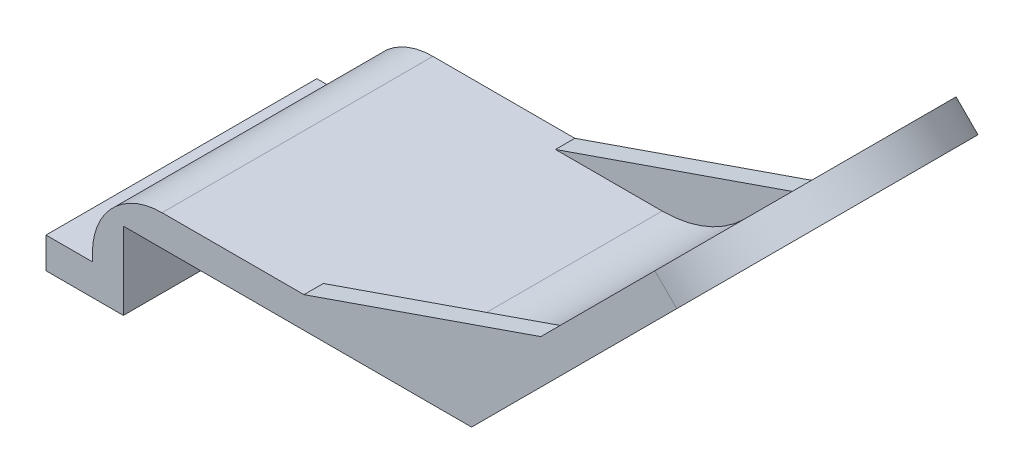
ISO-10303-21;
HEADER;
FILE_DESCRIPTION(('STEP AP214'),'2;1');
FILE_NAME('part.step','',(''),(''),'','','');
FILE_SCHEMA(('AUTOMOTIVE_DESIGN { 1 0 10303 214 1 1 1 1 }'));
ENDSEC;
DATA;
#1=APPLICATION_CONTEXT('core data for automotive mechanical design processes');
#2=APPLICATION_PROTOCOL_DEFINITION('international standard','automotive_design',2000,#1);
#3=PRODUCT_CONTEXT('',#1,'mechanical');
#4=PRODUCT('Part','Part','',(#3));
#5=PRODUCT_RELATED_PRODUCT_CATEGORY('part','',(#4));
#6=PRODUCT_DEFINITION_FORMATION('','',#4);
#7=PRODUCT_DEFINITION_CONTEXT('part definition',#1,'design');
#8=PRODUCT_DEFINITION('design','',#6,#7);
#9=PRODUCT_DEFINITION_SHAPE('','',#8);
#10=(LENGTH_UNIT() NAMED_UNIT(*) SI_UNIT(.MILLI.,.METRE.));
#11=(NAMED_UNIT(*) PLANE_ANGLE_UNIT() SI_UNIT($,.RADIAN.));
#12=(NAMED_UNIT(*) SI_UNIT($,.STERADIAN.) SOLID_ANGLE_UNIT());
#13=UNCERTAINTY_MEASURE_WITH_UNIT(LENGTH_MEASURE(1.E-05),#10,'distance_accuracy_value','');
#14=(GEOMETRIC_REPRESENTATION_CONTEXT(3) GLOBAL_UNCERTAINTY_ASSIGNED_CONTEXT((#13)) GLOBAL_UNIT_ASSIGNED_CONTEXT((#10,
#11,#12)) REPRESENTATION_CONTEXT('',''));
#15=CARTESIAN_POINT('',(0.,0.,0.));
#16=DIRECTION('',(0.,0.,1.));
#17=DIRECTION('',(1.,0.,0.));
#18=AXIS2_PLACEMENT_3D('',#15,#16,#17);
#19=CARTESIAN_POINT('',(0.,0.,88.9));
#20=DIRECTION('',(-0.707106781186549,0.707106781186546,0.));
#21=DIRECTION('',(-0.707106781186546,-0.707106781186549,0.));
#22=AXIS2_PLACEMENT_3D('',#19,#20,#21);
#23=PLANE('',#22);
#24=DIRECTION('',(0.707106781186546,0.707106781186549,0.));
#25=VECTOR('',#24,1.);
#26=CARTESIAN_POINT('',(0.,0.,-88.9));
#27=LINE('',#26,#25);
#28=CARTESIAN_POINT('',(0.,0.,-88.9));
#29=VERTEX_POINT('',#28);
#30=CARTESIAN_POINT('',(134.703841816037,134.703841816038,-88.9));
#31=VERTEX_POINT('',#30);
#32=EDGE_CURVE('E264',#29,#31,#27,.T.);
#33=ORIENTED_EDGE('',*,*,#32,.T.);
#34=CARTESIAN_POINT('',(134.703841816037,134.703841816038,0.));
#35=DIRECTION('',(-0.707106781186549,0.707106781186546,0.));
#36=DIRECTION('',(-0.707106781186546,-0.707106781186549,0.));
#37=AXIS2_PLACEMENT_3D('',#34,#35,#36);
#38=CIRCLE('',#37,88.9);
#39=CARTESIAN_POINT('',(134.703841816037,134.703841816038,88.9));
#40=VERTEX_POINT('',#39);
#41=EDGE_CURVE('E261',#31,#40,#38,.F.);
#42=ORIENTED_EDGE('',*,*,#41,.T.);
#43=DIRECTION('',(0.707106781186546,0.707106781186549,0.));
#44=VECTOR('',#43,1.);
#45=CARTESIAN_POINT('',(0.,0.,88.9));
#46=LINE('',#45,#44);
#47=CARTESIAN_POINT('',(0.,0.,88.9));
#48=VERTEX_POINT('',#47);
#49=EDGE_CURVE('E201',#48,#40,#46,.T.);
#50=ORIENTED_EDGE('',*,*,#49,.F.);
#51=DIRECTION('',(0.,0.,-1.));
#52=VECTOR('',#51,1.);
#53=CARTESIAN_POINT('',(0.,0.,88.9));
#54=LINE('',#53,#52);
#55=EDGE_CURVE('E202',#48,#29,#54,.T.);
#56=ORIENTED_EDGE('',*,*,#55,.T.);
#57=EDGE_LOOP('',(#33,#42,#50,#56));
#58=FACE_BOUND('',#57,.T.);
#59=CARTESIAN_POINT('',(134.703841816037,134.703841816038,0.));
#60=DIRECTION('',(-0.707106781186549,0.707106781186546,0.));
#61=DIRECTION('',(-0.707106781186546,-0.707106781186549,0.));
#62=AXIS2_PLACEMENT_3D('',#59,#60,#61);
#63=CIRCLE('',#62,25.4);
#64=CARTESIAN_POINT('',(116.743329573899,116.743329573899,0.));
#65=VERTEX_POINT('',#64);
#66=EDGE_CURVE('E257',#65,#65,#63,.T.);
#67=ORIENTED_EDGE('',*,*,#66,.T.);
#68=EDGE_LOOP('',(#67));
#69=FACE_BOUND('',#68,.T.);
#70=ADVANCED_FACE('F43',(#58,#69),#23,.F.);
#71=CARTESIAN_POINT('',(-14.3684097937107,14.3684097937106,88.9));
#72=DIRECTION('',(-0.707106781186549,0.707106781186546,0.));
#73=DIRECTION('',(-0.707106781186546,-0.707106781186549,0.));
#74=AXIS2_PLACEMENT_3D('',#71,#72,#73);
#75=PLANE('',#74);
#76=DIRECTION('',(-0.707106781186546,-0.707106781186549,0.));
#77=VECTOR('',#76,1.);
#78=CARTESIAN_POINT('',(-14.3684097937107,14.3684097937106,-76.2));
#79=LINE('',#78,#77);
#80=CARTESIAN_POINT('',(45.4647171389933,74.2015367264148,-76.2));
#81=VERTEX_POINT('',#80);
#82=CARTESIAN_POINT('',(13.9016436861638,42.6384632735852,-76.2));
#83=VERTEX_POINT('',#82);
#84=EDGE_CURVE('E237',#81,#83,#79,.T.);
#85=ORIENTED_EDGE('',*,*,#84,.T.);
#86=DIRECTION('',(0.,0.,-1.));
#87=VECTOR('',#86,1.);
#88=CARTESIAN_POINT('',(13.9016436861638,42.6384632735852,76.2));
#89=LINE('',#88,#87);
#90=CARTESIAN_POINT('',(13.9016436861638,42.6384632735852,76.2));
#91=VERTEX_POINT('',#90);
#92=EDGE_CURVE('E51',#83,#91,#89,.F.);
#93=ORIENTED_EDGE('',*,*,#92,.T.);
#94=DIRECTION('',(0.707106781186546,0.707106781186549,0.));
#95=VECTOR('',#94,1.);
#96=CARTESIAN_POINT('',(-14.3684097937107,14.3684097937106,76.2));
#97=LINE('',#96,#95);
#98=CARTESIAN_POINT('',(45.4647171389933,74.2015367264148,76.2));
#99=VERTEX_POINT('',#98);
#100=EDGE_CURVE('E255',#91,#99,#97,.T.);
#101=ORIENTED_EDGE('',*,*,#100,.T.);
#102=DIRECTION('',(0.,0.,1.));
#103=VECTOR('',#102,1.);
#104=CARTESIAN_POINT('',(45.4647171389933,74.2015367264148,88.9));
#105=LINE('',#104,#103);
#106=CARTESIAN_POINT('',(45.4647171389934,74.2015367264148,88.9));
#107=VERTEX_POINT('',#106);
#108=EDGE_CURVE('E251',#107,#99,#105,.F.);
#109=ORIENTED_EDGE('',*,*,#108,.F.);
#110=DIRECTION('',(0.707106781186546,0.707106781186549,0.));
#111=VECTOR('',#110,1.);
#112=CARTESIAN_POINT('',(-14.3684097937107,14.3684097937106,88.9));
#113=LINE('',#112,#111);
#114=CARTESIAN_POINT('',(120.335432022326,149.072251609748,88.9));
#115=VERTEX_POINT('',#114);
#116=EDGE_CURVE('E271',#107,#115,#113,.T.);
#117=ORIENTED_EDGE('',*,*,#116,.T.);
#118=CARTESIAN_POINT('',(120.335432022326,149.072251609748,0.));
#119=DIRECTION('',(-0.707106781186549,0.707106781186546,0.));
#120=DIRECTION('',(0.707106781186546,0.707106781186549,0.));
#121=AXIS2_PLACEMENT_3D('',#118,#119,#120);
#122=CIRCLE('',#121,88.9);
#123=CARTESIAN_POINT('',(120.335432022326,149.072251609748,-88.9));
#124=VERTEX_POINT('',#123);
#125=EDGE_CURVE('E260',#115,#124,#122,.T.);
#126=ORIENTED_EDGE('',*,*,#125,.T.);
#127=DIRECTION('',(0.707106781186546,0.707106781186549,0.));
#128=VECTOR('',#127,1.);
#129=CARTESIAN_POINT('',(-14.3684097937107,14.3684097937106,-88.9));
#130=LINE('',#129,#128);
#131=CARTESIAN_POINT('',(45.4647171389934,74.2015367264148,-88.9));
#132=VERTEX_POINT('',#131);
#133=EDGE_CURVE('E181',#132,#124,#130,.T.);
#134=ORIENTED_EDGE('',*,*,#133,.F.);
#135=DIRECTION('',(0.,0.,-1.));
#136=VECTOR('',#135,1.);
#137=CARTESIAN_POINT('',(45.4647171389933,74.2015367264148,88.9));
#138=LINE('',#137,#136);
#139=EDGE_CURVE('E161',#81,#132,#138,.T.);
#140=ORIENTED_EDGE('',*,*,#139,.F.);
#141=EDGE_LOOP('',(#85,#93,#101,#109,#117,#126,#134,#140));
#142=FACE_BOUND('',#141,.T.);
#143=CARTESIAN_POINT('',(120.335432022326,149.072251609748,0.));
#144=DIRECTION('',(-0.707106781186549,0.707106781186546,0.));
#145=DIRECTION('',(-0.707106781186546,-0.707106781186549,0.));
#146=AXIS2_PLACEMENT_3D('',#143,#144,#145);
#147=CIRCLE('',#146,59.0969078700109);
#148=CARTESIAN_POINT('',(78.5476077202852,107.284427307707,0.));
#149=VERTEX_POINT('',#148);
#150=EDGE_CURVE('E217',#149,#149,#147,.F.);
#151=ORIENTED_EDGE('',*,*,#150,.T.);
#152=EDGE_LOOP('',(#151));
#153=FACE_BOUND('',#152,.T.);
#154=ADVANCED_FACE('F294',(#142,#153),#75,.T.);
#155=CARTESIAN_POINT('',(-228.6,20.32,88.9));
#156=DIRECTION('',(0.,1.,0.));
#157=DIRECTION('',(0.,0.,1.));
#158=AXIS2_PLACEMENT_3D('',#155,#156,#157);
#159=PLANE('',#158);
#160=DIRECTION('',(1.,0.,0.));
#161=VECTOR('',#160,1.);
#162=CARTESIAN_POINT('',(-228.6,20.32,76.2));
#163=LINE('',#162,#161);
#164=CARTESIAN_POINT('',(-110.016819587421,20.32,76.2));
#165=VERTEX_POINT('',#164);
#166=CARTESIAN_POINT('',(-39.9798930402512,20.32,76.2));
#167=VERTEX_POINT('',#166);
#168=EDGE_CURVE('E233',#165,#167,#163,.T.);
#169=ORIENTED_EDGE('',*,*,#168,.T.);
#170=DIRECTION('',(0.,0.,-1.));
#171=VECTOR('',#170,1.);
#172=CARTESIAN_POINT('',(-39.9798930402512,20.32,-76.2));
#173=LINE('',#172,#171);
#174=CARTESIAN_POINT('',(-39.9798930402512,20.32,-76.2));
#175=VERTEX_POINT('',#174);
#176=EDGE_CURVE('E229',#167,#175,#173,.T.);
#177=ORIENTED_EDGE('',*,*,#176,.T.);
#178=DIRECTION('',(-1.,0.,0.));
#179=VECTOR('',#178,1.);
#180=CARTESIAN_POINT('',(-228.6,20.32,-76.2));
#181=LINE('',#180,#179);
#182=CARTESIAN_POINT('',(-110.016819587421,20.32,-76.2));
#183=VERTEX_POINT('',#182);
#184=EDGE_CURVE('E174',#175,#183,#181,.T.);
#185=ORIENTED_EDGE('',*,*,#184,.T.);
#186=DIRECTION('',(0.,0.,1.));
#187=VECTOR('',#186,1.);
#188=CARTESIAN_POINT('',(-110.016819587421,20.32,88.9));
#189=LINE('',#188,#187);
#190=CARTESIAN_POINT('',(-110.016819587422,20.3199999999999,-88.9));
#191=VERTEX_POINT('',#190);
#192=EDGE_CURVE('E158',#191,#183,#189,.T.);
#193=ORIENTED_EDGE('',*,*,#192,.F.);
#194=DIRECTION('',(1.,0.,0.));
#195=VECTOR('',#194,1.);
#196=CARTESIAN_POINT('',(-228.6,20.32,-88.9));
#197=LINE('',#196,#195);
#198=CARTESIAN_POINT('',(-203.2,20.32,-88.9));
#199=VERTEX_POINT('',#198);
#200=EDGE_CURVE('E171',#199,#191,#197,.T.);
#201=ORIENTED_EDGE('',*,*,#200,.F.);
#202=DIRECTION('',(0.,0.,-1.));
#203=VECTOR('',#202,1.);
#204=CARTESIAN_POINT('',(-203.2,20.32,88.9));
#205=LINE('',#204,#203);
#206=CARTESIAN_POINT('',(-203.2,20.32,88.9));
#207=VERTEX_POINT('',#206);
#208=EDGE_CURVE('E224',#199,#207,#205,.F.);
#209=ORIENTED_EDGE('',*,*,#208,.T.);
#210=DIRECTION('',(1.,0.,0.));
#211=VECTOR('',#210,1.);
#212=CARTESIAN_POINT('',(-228.6,20.32,88.9));
#213=LINE('',#212,#211);
#214=CARTESIAN_POINT('',(-110.016819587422,20.32,88.9));
#215=VERTEX_POINT('',#214);
#216=EDGE_CURVE('E273',#207,#215,#213,.T.);
#217=ORIENTED_EDGE('',*,*,#216,.T.);
#218=DIRECTION('',(0.,0.,-1.));
#219=VECTOR('',#218,1.);
#220=CARTESIAN_POINT('',(-110.016819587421,20.32,88.9));
#221=LINE('',#220,#219);
#222=EDGE_CURVE('E246',#165,#215,#221,.F.);
#223=ORIENTED_EDGE('',*,*,#222,.F.);
#224=EDGE_LOOP('',(#169,#177,#185,#193,#201,#209,#217,#223));
#225=FACE_BOUND('',#224,.T.);
#226=ADVANCED_FACE('F170',(#225),#159,.T.);
#227=CARTESIAN_POINT('',(-248.92,-50.8,88.9));
#228=DIRECTION('',(-1.,0.,0.));
#229=DIRECTION('',(0.,0.,1.));
#230=AXIS2_PLACEMENT_3D('',#227,#228,#229);
#231=PLANE('',#230);
#232=DIRECTION('',(0.,0.,-1.));
#233=VECTOR('',#232,1.);
#234=CARTESIAN_POINT('',(-248.92,-25.4,88.9));
#235=LINE('',#234,#233);
#236=CARTESIAN_POINT('',(-248.92,-25.4,88.9));
#237=VERTEX_POINT('',#236);
#238=CARTESIAN_POINT('',(-248.92,-25.4,-88.9));
#239=VERTEX_POINT('',#238);
#240=EDGE_CURVE('E220',#237,#239,#235,.T.);
#241=ORIENTED_EDGE('',*,*,#240,.T.);
#242=DIRECTION('',(0.,1.,0.));
#243=VECTOR('',#242,1.);
#244=CARTESIAN_POINT('',(-248.92,-50.8,-88.9));
#245=LINE('',#244,#243);
#246=CARTESIAN_POINT('',(-248.92,-30.48,-88.9));
#247=VERTEX_POINT('',#246);
#248=EDGE_CURVE('E180',#247,#239,#245,.T.);
#249=ORIENTED_EDGE('',*,*,#248,.F.);
#250=DIRECTION('',(0.,0.,-1.));
#251=VECTOR('',#250,1.);
#252=CARTESIAN_POINT('',(-248.92,-30.48,88.9));
#253=LINE('',#252,#251);
#254=CARTESIAN_POINT('',(-248.92,-30.48,88.9));
#255=VERTEX_POINT('',#254);
#256=EDGE_CURVE('E215',#255,#247,#253,.T.);
#257=ORIENTED_EDGE('',*,*,#256,.F.);
#258=DIRECTION('',(0.,1.,0.));
#259=VECTOR('',#258,1.);
#260=CARTESIAN_POINT('',(-248.92,-50.8,88.9));
#261=LINE('',#260,#259);
#262=EDGE_CURVE('E275',#255,#237,#261,.T.);
#263=ORIENTED_EDGE('',*,*,#262,.T.);
#264=EDGE_LOOP('',(#241,#249,#257,#263));
#265=FACE_BOUND('',#264,.T.);
#266=ADVANCED_FACE('F328',(#265),#231,.T.);
#267=CARTESIAN_POINT('',(-279.4,-30.48,88.9));
#268=DIRECTION('',(0.,1.,0.));
#269=DIRECTION('',(0.,0.,1.));
#270=AXIS2_PLACEMENT_3D('',#267,#268,#269);
#271=PLANE('',#270);
#272=ORIENTED_EDGE('',*,*,#256,.T.);
#273=DIRECTION('',(1.,0.,0.));
#274=VECTOR('',#273,1.);
#275=CARTESIAN_POINT('',(-279.4,-30.48,-88.9));
#276=LINE('',#275,#274);
#277=CARTESIAN_POINT('',(-279.4,-30.48,-88.9));
#278=VERTEX_POINT('',#277);
#279=EDGE_CURVE('E183',#278,#247,#276,.T.);
#280=ORIENTED_EDGE('',*,*,#279,.F.);
#281=DIRECTION('',(0.,0.,-1.));
#282=VECTOR('',#281,1.);
#283=CARTESIAN_POINT('',(-279.4,-30.48,88.9));
#284=LINE('',#283,#282);
#285=CARTESIAN_POINT('',(-279.4,-30.48,88.9));
#286=VERTEX_POINT('',#285);
#287=EDGE_CURVE('E212',#286,#278,#284,.T.);
#288=ORIENTED_EDGE('',*,*,#287,.F.);
#289=DIRECTION('',(1.,0.,0.));
#290=VECTOR('',#289,1.);
#291=CARTESIAN_POINT('',(-279.4,-30.48,88.9));
#292=LINE('',#291,#290);
#293=EDGE_CURVE('E277',#286,#255,#292,.T.);
#294=ORIENTED_EDGE('',*,*,#293,.T.);
#295=EDGE_LOOP('',(#272,#280,#288,#294));
#296=FACE_BOUND('',#295,.T.);
#297=ADVANCED_FACE('F335',(#296),#271,.T.);
#298=CARTESIAN_POINT('',(-279.4,-50.8,88.9));
#299=DIRECTION('',(-1.,0.,0.));
#300=DIRECTION('',(0.,0.,1.));
#301=AXIS2_PLACEMENT_3D('',#298,#299,#300);
#302=PLANE('',#301);
#303=ORIENTED_EDGE('',*,*,#287,.T.);
#304=DIRECTION('',(0.,1.,0.));
#305=VECTOR('',#304,1.);
#306=CARTESIAN_POINT('',(-279.4,-50.8,-88.9));
#307=LINE('',#306,#305);
#308=CARTESIAN_POINT('',(-279.4,-50.8,-88.9));
#309=VERTEX_POINT('',#308);
#310=EDGE_CURVE('E191',#309,#278,#307,.T.);
#311=ORIENTED_EDGE('',*,*,#310,.F.);
#312=DIRECTION('',(0.,0.,-1.));
#313=VECTOR('',#312,1.);
#314=CARTESIAN_POINT('',(-279.4,-50.8,88.9));
#315=LINE('',#314,#313);
#316=CARTESIAN_POINT('',(-279.4,-50.8,88.9));
#317=VERTEX_POINT('',#316);
#318=EDGE_CURVE('E210',#317,#309,#315,.T.);
#319=ORIENTED_EDGE('',*,*,#318,.F.);
#320=DIRECTION('',(0.,1.,0.));
#321=VECTOR('',#320,1.);
#322=CARTESIAN_POINT('',(-279.4,-50.8,88.9));
#323=LINE('',#322,#321);
#324=EDGE_CURVE('E279',#317,#286,#323,.T.);
#325=ORIENTED_EDGE('',*,*,#324,.T.);
#326=EDGE_LOOP('',(#303,#311,#319,#325));
#327=FACE_BOUND('',#326,.T.);
#328=ADVANCED_FACE('F321',(#327),#302,.T.);
#329=CARTESIAN_POINT('',(-279.4,-50.8,88.9));
#330=DIRECTION('',(0.,1.,0.));
#331=DIRECTION('',(0.,0.,1.));
#332=AXIS2_PLACEMENT_3D('',#329,#330,#331);
#333=PLANE('',#332);
#334=DIRECTION('',(1.,0.,0.));
#335=VECTOR('',#334,1.);
#336=CARTESIAN_POINT('',(-279.4,-50.8,-88.9));
#337=LINE('',#336,#335);
#338=CARTESIAN_POINT('',(-228.6,-50.8,-88.9));
#339=VERTEX_POINT('',#338);
#340=EDGE_CURVE('E193',#309,#339,#337,.T.);
#341=ORIENTED_EDGE('',*,*,#340,.T.);
#342=DIRECTION('',(0.,0.,-1.));
#343=VECTOR('',#342,1.);
#344=CARTESIAN_POINT('',(-228.6,-50.8,88.9));
#345=LINE('',#344,#343);
#346=CARTESIAN_POINT('',(-228.6,-50.8,88.9));
#347=VERTEX_POINT('',#346);
#348=EDGE_CURVE('E208',#347,#339,#345,.T.);
#349=ORIENTED_EDGE('',*,*,#348,.F.);
#350=DIRECTION('',(1.,0.,0.));
#351=VECTOR('',#350,1.);
#352=CARTESIAN_POINT('',(-279.4,-50.8,88.9));
#353=LINE('',#352,#351);
#354=EDGE_CURVE('E281',#317,#347,#353,.T.);
#355=ORIENTED_EDGE('',*,*,#354,.F.);
#356=ORIENTED_EDGE('',*,*,#318,.T.);
#357=EDGE_LOOP('',(#341,#349,#355,#356));
#358=FACE_BOUND('',#357,.T.);
#359=ADVANCED_FACE('F318',(#358),#333,.F.);
#360=CARTESIAN_POINT('',(-228.6,-50.8,88.9));
#361=DIRECTION('',(-1.,0.,0.));
#362=DIRECTION('',(0.,0.,1.));
#363=AXIS2_PLACEMENT_3D('',#360,#361,#362);
#364=PLANE('',#363);
#365=DIRECTION('',(0.,1.,0.));
#366=VECTOR('',#365,1.);
#367=CARTESIAN_POINT('',(-228.6,-50.8,-88.9));
#368=LINE('',#367,#366);
#369=CARTESIAN_POINT('',(-228.6,0.,-88.9));
#370=VERTEX_POINT('',#369);
#371=EDGE_CURVE('E196',#339,#370,#368,.T.);
#372=ORIENTED_EDGE('',*,*,#371,.T.);
#373=DIRECTION('',(0.,0.,-1.));
#374=VECTOR('',#373,1.);
#375=CARTESIAN_POINT('',(-228.6,0.,88.9));
#376=LINE('',#375,#374);
#377=CARTESIAN_POINT('',(-228.6,0.,88.9));
#378=VERTEX_POINT('',#377);
#379=EDGE_CURVE('E204',#378,#370,#376,.T.);
#380=ORIENTED_EDGE('',*,*,#379,.F.);
#381=DIRECTION('',(0.,1.,0.));
#382=VECTOR('',#381,1.);
#383=CARTESIAN_POINT('',(-228.6,-50.8,88.9));
#384=LINE('',#383,#382);
#385=EDGE_CURVE('E283',#347,#378,#384,.T.);
#386=ORIENTED_EDGE('',*,*,#385,.F.);
#387=ORIENTED_EDGE('',*,*,#348,.T.);
#388=EDGE_LOOP('',(#372,#380,#386,#387));
#389=FACE_BOUND('',#388,.T.);
#390=ADVANCED_FACE('F313',(#389),#364,.F.);
#391=CARTESIAN_POINT('',(-228.6,0.,88.9));
#392=DIRECTION('',(0.,1.,0.));
#393=DIRECTION('',(0.,0.,1.));
#394=AXIS2_PLACEMENT_3D('',#391,#392,#393);
#395=PLANE('',#394);
#396=DIRECTION('',(1.,0.,0.));
#397=VECTOR('',#396,1.);
#398=CARTESIAN_POINT('',(-228.6,0.,-88.9));
#399=LINE('',#398,#397);
#400=EDGE_CURVE('E198',#370,#29,#399,.T.);
#401=ORIENTED_EDGE('',*,*,#400,.T.);
#402=ORIENTED_EDGE('',*,*,#55,.F.);
#403=DIRECTION('',(1.,0.,0.));
#404=VECTOR('',#403,1.);
#405=CARTESIAN_POINT('',(-228.6,0.,88.9));
#406=LINE('',#405,#404);
#407=EDGE_CURVE('E205',#378,#48,#406,.T.);
#408=ORIENTED_EDGE('',*,*,#407,.F.);
#409=ORIENTED_EDGE('',*,*,#379,.T.);
#410=EDGE_LOOP('',(#401,#402,#408,#409));
#411=FACE_BOUND('',#410,.T.);
#412=ADVANCED_FACE('F307',(#411),#395,.F.);
#413=CARTESIAN_POINT('',(0.,0.,88.9));
#414=DIRECTION('',(0.,0.,-1.));
#415=DIRECTION('',(-1.,0.,0.));
#416=AXIS2_PLACEMENT_3D('',#413,#414,#415);
#417=PLANE('',#416);
#418=ORIENTED_EDGE('',*,*,#116,.F.);
#419=DIRECTION('',(0.944871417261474,0.327441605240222,0.));
#420=VECTOR('',#419,1.);
#421=CARTESIAN_POINT('',(-110.016819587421,20.32,88.9));
#422=LINE('',#421,#420);
#423=EDGE_CURVE('E243',#215,#107,#422,.T.);
#424=ORIENTED_EDGE('',*,*,#423,.F.);
#425=ORIENTED_EDGE('',*,*,#216,.F.);
#426=CARTESIAN_POINT('',(-203.2,-25.4,88.9));
#427=DIRECTION('',(0.,0.,-1.));
#428=DIRECTION('',(-1.,0.,0.));
#429=AXIS2_PLACEMENT_3D('',#426,#427,#428);
#430=CIRCLE('',#429,45.72);
#431=EDGE_CURVE('E226',#207,#237,#430,.F.);
#432=ORIENTED_EDGE('',*,*,#431,.T.);
#433=ORIENTED_EDGE('',*,*,#262,.F.);
#434=ORIENTED_EDGE('',*,*,#293,.F.);
#435=ORIENTED_EDGE('',*,*,#324,.F.);
#436=ORIENTED_EDGE('',*,*,#354,.T.);
#437=ORIENTED_EDGE('',*,*,#385,.T.);
#438=ORIENTED_EDGE('',*,*,#407,.T.);
#439=ORIENTED_EDGE('',*,*,#49,.T.);
#440=DIRECTION('',(0.707106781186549,-0.707106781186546,0.));
#441=VECTOR('',#440,1.);
#442=CARTESIAN_POINT('',(120.335432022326,149.072251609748,88.9));
#443=LINE('',#442,#441);
#444=EDGE_CURVE('E268',#115,#40,#443,.T.);
#445=ORIENTED_EDGE('',*,*,#444,.F.);
#446=EDGE_LOOP('',(#418,#424,#425,#432,#433,#434,#435,#436,#437,#438,#439,#445));
#447=FACE_BOUND('',#446,.T.);
#448=ADVANCED_FACE('F299',(#447),#417,.F.);
#449=CARTESIAN_POINT('',(0.,0.,-88.9));
#450=DIRECTION('',(0.,0.,-1.));
#451=DIRECTION('',(-1.,0.,0.));
#452=AXIS2_PLACEMENT_3D('',#449,#450,#451);
#453=PLANE('',#452);
#454=DIRECTION('',(0.707106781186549,-0.707106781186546,0.));
#455=VECTOR('',#454,1.);
#456=CARTESIAN_POINT('',(120.335432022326,149.072251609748,-88.9));
#457=LINE('',#456,#455);
#458=EDGE_CURVE('E185',#124,#31,#457,.T.);
#459=ORIENTED_EDGE('',*,*,#458,.T.);
#460=ORIENTED_EDGE('',*,*,#32,.F.);
#461=ORIENTED_EDGE('',*,*,#400,.F.);
#462=ORIENTED_EDGE('',*,*,#371,.F.);
#463=ORIENTED_EDGE('',*,*,#340,.F.);
#464=ORIENTED_EDGE('',*,*,#310,.T.);
#465=ORIENTED_EDGE('',*,*,#279,.T.);
#466=ORIENTED_EDGE('',*,*,#248,.T.);
#467=CARTESIAN_POINT('',(-203.2,-25.4,-88.9));
#468=DIRECTION('',(0.,0.,-1.));
#469=DIRECTION('',(-1.,0.,0.));
#470=AXIS2_PLACEMENT_3D('',#467,#468,#469);
#471=CIRCLE('',#470,45.72);
#472=EDGE_CURVE('E179',#239,#199,#471,.T.);
#473=ORIENTED_EDGE('',*,*,#472,.T.);
#474=ORIENTED_EDGE('',*,*,#200,.T.);
#475=DIRECTION('',(0.944871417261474,0.327441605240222,0.));
#476=VECTOR('',#475,1.);
#477=CARTESIAN_POINT('',(-110.016819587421,20.32,-88.9));
#478=LINE('',#477,#476);
#479=EDGE_CURVE('E154',#191,#132,#478,.T.);
#480=ORIENTED_EDGE('',*,*,#479,.T.);
#481=ORIENTED_EDGE('',*,*,#133,.T.);
#482=EDGE_LOOP('',(#459,#460,#461,#462,#463,#464,#465,#466,#473,#474,#480,#481));
#483=FACE_BOUND('',#482,.T.);
#484=ADVANCED_FACE('F177',(#483),#453,.T.);
#485=CARTESIAN_POINT('',(275.267083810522,-5.85940017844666,0.));
#486=DIRECTION('',(-0.707106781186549,0.707106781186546,0.));
#487=DIRECTION('',(-0.707106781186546,-0.707106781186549,0.));
#488=AXIS2_PLACEMENT_3D('',#485,#486,#487);
#489=CYLINDRICAL_SURFACE('',#488,88.9);
#490=ORIENTED_EDGE('',*,*,#41,.F.);
#491=ORIENTED_EDGE('',*,*,#458,.F.);
#492=ORIENTED_EDGE('',*,*,#125,.F.);
#493=ORIENTED_EDGE('',*,*,#444,.T.);
#494=EDGE_LOOP('',(#490,#491,#492,#493));
#495=FACE_BOUND('',#494,.T.);
#496=ADVANCED_FACE('F292',(#495),#489,.T.);
#497=CARTESIAN_POINT('',(147.276200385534,122.131483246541,0.));
#498=DIRECTION('',(-0.707106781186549,0.707106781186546,0.));
#499=DIRECTION('',(-0.707106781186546,-0.707106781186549,0.));
#500=AXIS2_PLACEMENT_3D('',#497,#498,#499);
#501=TOROIDAL_SURFACE('',#500,59.0969078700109,38.1);
#502=ORIENTED_EDGE('',*,*,#150,.F.);
#503=EDGE_LOOP('',(#502));
#504=FACE_BOUND('',#503,.T.);
#505=ORIENTED_EDGE('',*,*,#66,.F.);
#506=EDGE_LOOP('',(#505));
#507=FACE_BOUND('',#506,.T.);
#508=ADVANCED_FACE('F353',(#504,#507),#501,.T.);
#509=CARTESIAN_POINT('',(-203.2,-25.4,88.9));
#510=DIRECTION('',(0.,0.,-1.));
#511=DIRECTION('',(-1.,0.,0.));
#512=AXIS2_PLACEMENT_3D('',#509,#510,#511);
#513=CYLINDRICAL_SURFACE('',#512,45.72);
#514=ORIENTED_EDGE('',*,*,#431,.F.);
#515=ORIENTED_EDGE('',*,*,#208,.F.);
#516=ORIENTED_EDGE('',*,*,#472,.F.);
#517=ORIENTED_EDGE('',*,*,#240,.F.);
#518=EDGE_LOOP('',(#514,#515,#516,#517));
#519=FACE_BOUND('',#518,.T.);
#520=ADVANCED_FACE('F333',(#519),#513,.T.);
#521=CARTESIAN_POINT('',(-110.016819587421,20.32,88.9));
#522=DIRECTION('',(0.327441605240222,-0.944871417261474,0.));
#523=DIRECTION('',(0.944871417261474,0.327441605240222,0.));
#524=AXIS2_PLACEMENT_3D('',#521,#522,#523);
#525=PLANE('',#524);
#526=ORIENTED_EDGE('',*,*,#423,.T.);
#527=ORIENTED_EDGE('',*,*,#108,.T.);
#528=DIRECTION('',(0.944871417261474,0.327441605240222,0.));
#529=VECTOR('',#528,1.);
#530=CARTESIAN_POINT('',(-110.016819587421,20.32,76.2));
#531=LINE('',#530,#529);
#532=EDGE_CURVE('E239',#165,#99,#531,.T.);
#533=ORIENTED_EDGE('',*,*,#532,.F.);
#534=ORIENTED_EDGE('',*,*,#222,.T.);
#535=EDGE_LOOP('',(#526,#527,#533,#534));
#536=FACE_BOUND('',#535,.T.);
#537=ADVANCED_FACE('F357',(#536),#525,.F.);
#538=CARTESIAN_POINT('',(-40.9171826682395,80.5670222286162,76.2));
#539=DIRECTION('',(0.,0.,1.));
#540=DIRECTION('',(1.,0.,0.));
#541=AXIS2_PLACEMENT_3D('',#538,#539,#540);
#542=PLANE('',#541);
#543=ORIENTED_EDGE('',*,*,#100,.F.);
#544=CARTESIAN_POINT('',(-39.9798930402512,96.52,76.2));
#545=DIRECTION('',(0.,0.,1.));
#546=DIRECTION('',(1.,0.,0.));
#547=AXIS2_PLACEMENT_3D('',#544,#545,#546);
#548=CIRCLE('',#547,76.2);
#549=EDGE_CURVE('E11',#91,#167,#548,.F.);
#550=ORIENTED_EDGE('',*,*,#549,.T.);
#551=ORIENTED_EDGE('',*,*,#168,.F.);
#552=ORIENTED_EDGE('',*,*,#532,.T.);
#553=EDGE_LOOP('',(#543,#550,#551,#552));
#554=FACE_BOUND('',#553,.T.);
#555=ADVANCED_FACE('F361',(#554),#542,.F.);
#556=CARTESIAN_POINT('',(-110.016819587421,20.32,-88.9));
#557=DIRECTION('',(-0.327441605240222,0.944871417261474,0.));
#558=DIRECTION('',(0.944871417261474,0.327441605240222,0.));
#559=AXIS2_PLACEMENT_3D('',#556,#557,#558);
#560=PLANE('',#559);
#561=DIRECTION('',(0.944871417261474,0.327441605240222,0.));
#562=VECTOR('',#561,1.);
#563=CARTESIAN_POINT('',(-110.016819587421,20.32,-76.2));
#564=LINE('',#563,#562);
#565=EDGE_CURVE('E165',#183,#81,#564,.T.);
#566=ORIENTED_EDGE('',*,*,#565,.T.);
#567=ORIENTED_EDGE('',*,*,#139,.T.);
#568=ORIENTED_EDGE('',*,*,#479,.F.);
#569=ORIENTED_EDGE('',*,*,#192,.T.);
#570=EDGE_LOOP('',(#566,#567,#568,#569));
#571=FACE_BOUND('',#570,.T.);
#572=ADVANCED_FACE('F157',(#571),#560,.T.);
#573=CARTESIAN_POINT('',(-40.9171826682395,80.5670222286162,-76.2));
#574=DIRECTION('',(0.,0.,-1.));
#575=DIRECTION('',(-1.,0.,0.));
#576=AXIS2_PLACEMENT_3D('',#573,#574,#575);
#577=PLANE('',#576);
#578=ORIENTED_EDGE('',*,*,#184,.F.);
#579=CARTESIAN_POINT('',(-39.9798930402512,96.52,-76.2));
#580=DIRECTION('',(0.,0.,-1.));
#581=DIRECTION('',(-1.,0.,0.));
#582=AXIS2_PLACEMENT_3D('',#579,#580,#581);
#583=CIRCLE('',#582,76.2);
#584=EDGE_CURVE('E65',#175,#83,#583,.F.);
#585=ORIENTED_EDGE('',*,*,#584,.T.);
#586=ORIENTED_EDGE('',*,*,#84,.F.);
#587=ORIENTED_EDGE('',*,*,#565,.F.);
#588=EDGE_LOOP('',(#578,#585,#586,#587));
#589=FACE_BOUND('',#588,.T.);
#590=ADVANCED_FACE('F236',(#589),#577,.F.);
#591=CARTESIAN_POINT('',(-39.9798930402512,96.52,88.9));
#592=DIRECTION('',(0.,0.,1.));
#593=DIRECTION('',(1.,0.,0.));
#594=AXIS2_PLACEMENT_3D('',#591,#592,#593);
#595=CYLINDRICAL_SURFACE('',#594,76.2);
#596=ORIENTED_EDGE('',*,*,#549,.F.);
#597=ORIENTED_EDGE('',*,*,#92,.F.);
#598=ORIENTED_EDGE('',*,*,#584,.F.);
#599=ORIENTED_EDGE('',*,*,#176,.F.);
#600=EDGE_LOOP('',(#596,#597,#598,#599));
#601=FACE_BOUND('',#600,.T.);
#602=ADVANCED_FACE('F45',(#601),#595,.F.);
#603=CLOSED_SHELL('',(#70,#154,#226,#266,#297,#328,#359,#390,#412,#448,#484,#496,#508,#520,#537,
#555,#572,#590,#602));
#604=MANIFOLD_SOLID_BREP('B2',#603);
#605=ADVANCED_BREP_SHAPE_REPRESENTATION('',(#18,#604),#14);
#606=SHAPE_DEFINITION_REPRESENTATION(#9,#605);
ENDSEC;
END-ISO-10303-21;
